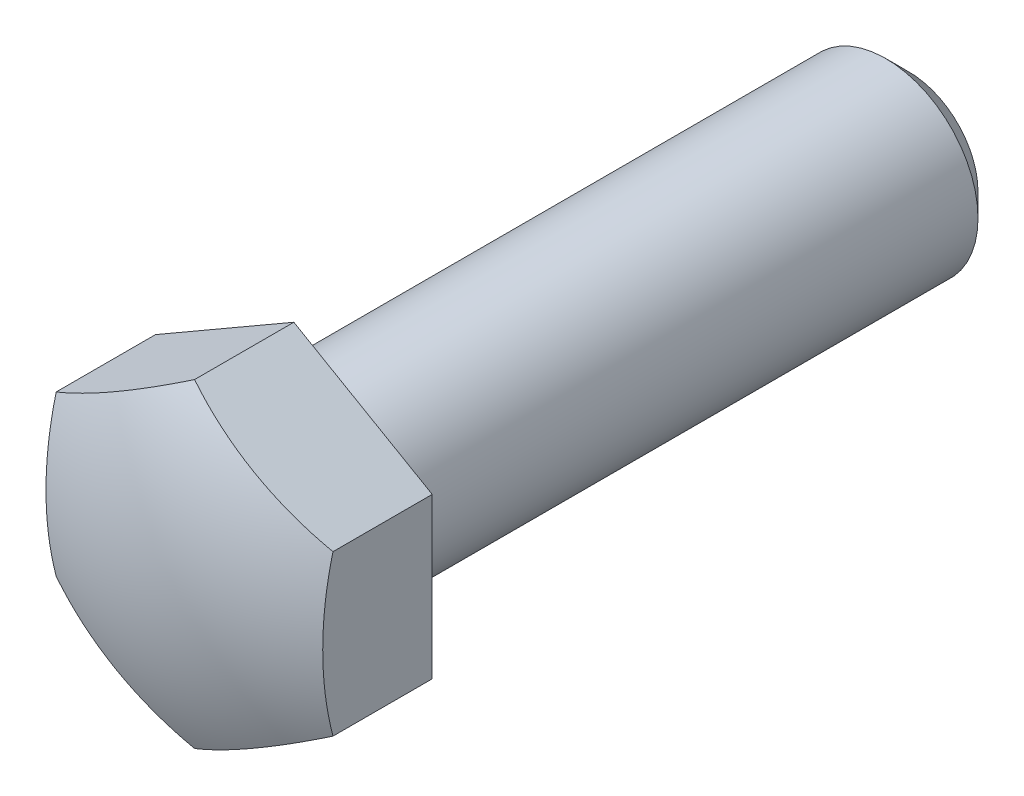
ISO-10303-21;
HEADER;
FILE_DESCRIPTION(('STEP AP214'),'2;1');
FILE_NAME('part.step','',(''),(''),'','','');
FILE_SCHEMA(('AUTOMOTIVE_DESIGN { 1 0 10303 214 1 1 1 1 }'));
ENDSEC;
DATA;
#1=APPLICATION_CONTEXT('core data for automotive mechanical design processes');
#2=APPLICATION_PROTOCOL_DEFINITION('international standard','automotive_design',2000,#1);
#3=PRODUCT_CONTEXT('',#1,'mechanical');
#4=PRODUCT('Part','Part','',(#3));
#5=PRODUCT_RELATED_PRODUCT_CATEGORY('part','',(#4));
#6=PRODUCT_DEFINITION_FORMATION('','',#4);
#7=PRODUCT_DEFINITION_CONTEXT('part definition',#1,'design');
#8=PRODUCT_DEFINITION('design','',#6,#7);
#9=PRODUCT_DEFINITION_SHAPE('','',#8);
#10=(LENGTH_UNIT() NAMED_UNIT(*) SI_UNIT(.MILLI.,.METRE.));
#11=(NAMED_UNIT(*) PLANE_ANGLE_UNIT() SI_UNIT($,.RADIAN.));
#12=(NAMED_UNIT(*) SI_UNIT($,.STERADIAN.) SOLID_ANGLE_UNIT());
#13=UNCERTAINTY_MEASURE_WITH_UNIT(LENGTH_MEASURE(1.E-05),#10,'distance_accuracy_value','');
#14=(GEOMETRIC_REPRESENTATION_CONTEXT(3) GLOBAL_UNCERTAINTY_ASSIGNED_CONTEXT((#13)) GLOBAL_UNIT_ASSIGNED_CONTEXT((#10,
#11,#12)) REPRESENTATION_CONTEXT('',''));
#15=CARTESIAN_POINT('',(0.,0.,0.));
#16=DIRECTION('',(0.,0.,1.));
#17=DIRECTION('',(1.,0.,0.));
#18=AXIS2_PLACEMENT_3D('',#15,#16,#17);
#19=CARTESIAN_POINT('',(12.,0.,0.));
#20=DIRECTION('',(0.,0.,1.));
#21=DIRECTION('',(1.,0.,0.));
#22=AXIS2_PLACEMENT_3D('',#19,#20,#21);
#23=PLANE('',#22);
#24=CARTESIAN_POINT('',(0.,0.,0.));
#25=DIRECTION('',(0.,0.,1.));
#26=DIRECTION('',(1.,0.,0.));
#27=AXIS2_PLACEMENT_3D('',#24,#25,#26);
#28=CIRCLE('',#27,12.);
#29=CARTESIAN_POINT('',(12.,0.,0.));
#30=VERTEX_POINT('',#29);
#31=EDGE_CURVE('E110',#30,#30,#28,.T.);
#32=ORIENTED_EDGE('',*,*,#31,.T.);
#33=EDGE_LOOP('',(#32));
#34=FACE_BOUND('',#33,.T.);
#35=DIRECTION('',(-0.86602540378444,-0.5,0.));
#36=VECTOR('',#35,1.);
#37=CARTESIAN_POINT('',(18.,-10.3923048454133,0.));
#38=LINE('',#37,#36);
#39=CARTESIAN_POINT('',(18.,-10.3923048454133,0.));
#40=VERTEX_POINT('',#39);
#41=CARTESIAN_POINT('',(0.,-20.7846096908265,0.));
#42=VERTEX_POINT('',#41);
#43=EDGE_CURVE('E107',#40,#42,#38,.T.);
#44=ORIENTED_EDGE('',*,*,#43,.T.);
#45=DIRECTION('',(0.86602540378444,-0.5,0.));
#46=VECTOR('',#45,1.);
#47=CARTESIAN_POINT('',(-18.,-10.3923048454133,0.));
#48=LINE('',#47,#46);
#49=CARTESIAN_POINT('',(-18.,-10.3923048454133,0.));
#50=VERTEX_POINT('',#49);
#51=EDGE_CURVE('E85',#50,#42,#48,.T.);
#52=ORIENTED_EDGE('',*,*,#51,.F.);
#53=DIRECTION('',(0.,-1.,0.));
#54=VECTOR('',#53,1.);
#55=CARTESIAN_POINT('',(-18.,10.3923048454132,0.));
#56=LINE('',#55,#54);
#57=CARTESIAN_POINT('',(-18.,10.3923048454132,0.));
#58=VERTEX_POINT('',#57);
#59=EDGE_CURVE('E62',#58,#50,#56,.T.);
#60=ORIENTED_EDGE('',*,*,#59,.F.);
#61=DIRECTION('',(0.866025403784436,0.5,0.));
#62=VECTOR('',#61,1.);
#63=CARTESIAN_POINT('',(-18.,10.3923048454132,0.));
#64=LINE('',#63,#62);
#65=CARTESIAN_POINT('',(0.,20.7846096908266,0.));
#66=VERTEX_POINT('',#65);
#67=EDGE_CURVE('E109',#58,#66,#64,.T.);
#68=ORIENTED_EDGE('',*,*,#67,.T.);
#69=DIRECTION('',(-0.866025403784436,0.5,0.));
#70=VECTOR('',#69,1.);
#71=CARTESIAN_POINT('',(18.,10.3923048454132,0.));
#72=LINE('',#71,#70);
#73=CARTESIAN_POINT('',(18.,10.3923048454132,0.));
#74=VERTEX_POINT('',#73);
#75=EDGE_CURVE('E100',#74,#66,#72,.T.);
#76=ORIENTED_EDGE('',*,*,#75,.F.);
#77=DIRECTION('',(0.,-1.,0.));
#78=VECTOR('',#77,1.);
#79=CARTESIAN_POINT('',(18.,10.3923048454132,0.));
#80=LINE('',#79,#78);
#81=EDGE_CURVE('E82',#74,#40,#80,.T.);
#82=ORIENTED_EDGE('',*,*,#81,.T.);
#83=EDGE_LOOP('',(#44,#52,#60,#68,#76,#82));
#84=FACE_BOUND('',#83,.T.);
#85=ADVANCED_FACE('F14',(#34,#84),#23,.F.);
#86=CARTESIAN_POINT('',(0.,0.,-20.));
#87=DIRECTION('',(0.,0.,1.));
#88=DIRECTION('',(1.,0.,0.));
#89=AXIS2_PLACEMENT_3D('',#86,#87,#88);
#90=CYLINDRICAL_SURFACE('',#89,12.);
#91=CARTESIAN_POINT('',(0.,0.,-77.));
#92=DIRECTION('',(0.,0.,1.));
#93=DIRECTION('',(1.,0.,0.));
#94=AXIS2_PLACEMENT_3D('',#91,#92,#93);
#95=CIRCLE('',#94,12.);
#96=CARTESIAN_POINT('',(12.,0.,-77.));
#97=VERTEX_POINT('',#96);
#98=EDGE_CURVE('E23',#97,#97,#95,.T.);
#99=ORIENTED_EDGE('',*,*,#98,.T.);
#100=EDGE_LOOP('',(#99));
#101=FACE_BOUND('',#100,.T.);
#102=ORIENTED_EDGE('',*,*,#31,.F.);
#103=EDGE_LOOP('',(#102));
#104=FACE_BOUND('',#103,.T.);
#105=ADVANCED_FACE('F146',(#101,#104),#90,.T.);
#106=CARTESIAN_POINT('',(0.,0.,-80.));
#107=DIRECTION('',(0.,0.,1.));
#108=DIRECTION('',(1.,0.,0.));
#109=AXIS2_PLACEMENT_3D('',#106,#107,#108);
#110=PLANE('',#109);
#111=CARTESIAN_POINT('',(0.,0.,-80.));
#112=DIRECTION('',(0.,0.,1.));
#113=DIRECTION('',(1.,0.,0.));
#114=AXIS2_PLACEMENT_3D('',#111,#112,#113);
#115=CIRCLE('',#114,9.);
#116=CARTESIAN_POINT('',(9.,0.,-80.));
#117=VERTEX_POINT('',#116);
#118=EDGE_CURVE('E9',#117,#117,#115,.F.);
#119=ORIENTED_EDGE('',*,*,#118,.T.);
#120=EDGE_LOOP('',(#119));
#121=FACE_BOUND('',#120,.T.);
#122=ADVANCED_FACE('F152',(#121),#110,.F.);
#123=CARTESIAN_POINT('',(-18.,-10.3923048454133,18.));
#124=DIRECTION('',(0.5,0.86602540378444,0.));
#125=DIRECTION('',(-0.86602540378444,0.5,0.));
#126=AXIS2_PLACEMENT_3D('',#123,#124,#125);
#127=PLANE('',#126);
#128=CARTESIAN_POINT('',(-9.,-15.5884572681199,-27.));
#129=DIRECTION('',(0.5,0.86602540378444,0.));
#130=DIRECTION('',(-0.86602540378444,0.5,0.));
#131=AXIS2_PLACEMENT_3D('',#128,#129,#130);
#132=CIRCLE('',#131,41.2431812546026);
#133=CARTESIAN_POINT('',(0.,-20.7846096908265,12.9124040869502));
#134=VERTEX_POINT('',#133);
#135=CARTESIAN_POINT('',(-18.,-10.3923048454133,12.9124040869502));
#136=VERTEX_POINT('',#135);
#137=EDGE_CURVE('E76',#134,#136,#132,.F.);
#138=ORIENTED_EDGE('',*,*,#137,.T.);
#139=DIRECTION('',(0.,0.,-1.));
#140=VECTOR('',#139,1.);
#141=CARTESIAN_POINT('',(-18.,-10.3923048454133,18.));
#142=LINE('',#141,#140);
#143=EDGE_CURVE('E78',#136,#50,#142,.T.);
#144=ORIENTED_EDGE('',*,*,#143,.T.);
#145=ORIENTED_EDGE('',*,*,#51,.T.);
#146=DIRECTION('',(0.,0.,-1.));
#147=VECTOR('',#146,1.);
#148=CARTESIAN_POINT('',(0.,-20.7846096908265,18.));
#149=LINE('',#148,#147);
#150=EDGE_CURVE('E31',#134,#42,#149,.T.);
#151=ORIENTED_EDGE('',*,*,#150,.F.);
#152=EDGE_LOOP('',(#138,#144,#145,#151));
#153=FACE_BOUND('',#152,.T.);
#154=ADVANCED_FACE('F77',(#153),#127,.F.);
#155=CARTESIAN_POINT('',(-18.,10.3923048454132,18.));
#156=DIRECTION('',(1.,0.,0.));
#157=DIRECTION('',(0.,1.,0.));
#158=AXIS2_PLACEMENT_3D('',#155,#156,#157);
#159=PLANE('',#158);
#160=CARTESIAN_POINT('',(-18.,0.,-27.));
#161=DIRECTION('',(1.,0.,0.));
#162=DIRECTION('',(0.,1.,0.));
#163=AXIS2_PLACEMENT_3D('',#160,#161,#162);
#164=CIRCLE('',#163,41.2431812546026);
#165=CARTESIAN_POINT('',(-18.,10.3923048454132,12.9124040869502));
#166=VERTEX_POINT('',#165);
#167=EDGE_CURVE('E71',#136,#166,#164,.F.);
#168=ORIENTED_EDGE('',*,*,#167,.T.);
#169=DIRECTION('',(0.,0.,-1.));
#170=VECTOR('',#169,1.);
#171=CARTESIAN_POINT('',(-18.,10.3923048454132,18.));
#172=LINE('',#171,#170);
#173=EDGE_CURVE('E91',#166,#58,#172,.T.);
#174=ORIENTED_EDGE('',*,*,#173,.T.);
#175=ORIENTED_EDGE('',*,*,#59,.T.);
#176=ORIENTED_EDGE('',*,*,#143,.F.);
#177=EDGE_LOOP('',(#168,#174,#175,#176));
#178=FACE_BOUND('',#177,.T.);
#179=ADVANCED_FACE('F84',(#178),#159,.F.);
#180=CARTESIAN_POINT('',(-18.,10.3923048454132,18.));
#181=DIRECTION('',(-0.5,0.866025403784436,0.));
#182=DIRECTION('',(-0.866025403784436,-0.5,0.));
#183=AXIS2_PLACEMENT_3D('',#180,#181,#182);
#184=PLANE('',#183);
#185=DIRECTION('',(0.,0.,-1.));
#186=VECTOR('',#185,1.);
#187=CARTESIAN_POINT('',(0.,20.7846096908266,18.));
#188=LINE('',#187,#186);
#189=CARTESIAN_POINT('',(0.,20.7846096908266,12.9124040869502));
#190=VERTEX_POINT('',#189);
#191=EDGE_CURVE('E53',#190,#66,#188,.T.);
#192=ORIENTED_EDGE('',*,*,#191,.T.);
#193=ORIENTED_EDGE('',*,*,#67,.F.);
#194=ORIENTED_EDGE('',*,*,#173,.F.);
#195=CARTESIAN_POINT('',(-9.,15.5884572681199,-27.));
#196=DIRECTION('',(-0.5,0.866025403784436,0.));
#197=DIRECTION('',(-0.866025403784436,-0.5,0.));
#198=AXIS2_PLACEMENT_3D('',#195,#196,#197);
#199=CIRCLE('',#198,41.2431812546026);
#200=EDGE_CURVE('E90',#190,#166,#199,.F.);
#201=ORIENTED_EDGE('',*,*,#200,.F.);
#202=EDGE_LOOP('',(#192,#193,#194,#201));
#203=FACE_BOUND('',#202,.T.);
#204=ADVANCED_FACE('F134',(#203),#184,.T.);
#205=CARTESIAN_POINT('',(18.,10.3923048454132,18.));
#206=DIRECTION('',(-0.5,-0.866025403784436,0.));
#207=DIRECTION('',(0.866025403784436,-0.5,0.));
#208=AXIS2_PLACEMENT_3D('',#205,#206,#207);
#209=PLANE('',#208);
#210=CARTESIAN_POINT('',(9.,15.5884572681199,-27.));
#211=DIRECTION('',(-0.5,-0.866025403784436,0.));
#212=DIRECTION('',(0.866025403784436,-0.5,0.));
#213=AXIS2_PLACEMENT_3D('',#210,#211,#212);
#214=CIRCLE('',#213,41.2431812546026);
#215=CARTESIAN_POINT('',(18.,10.3923048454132,12.9124040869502));
#216=VERTEX_POINT('',#215);
#217=EDGE_CURVE('E103',#190,#216,#214,.F.);
#218=ORIENTED_EDGE('',*,*,#217,.T.);
#219=DIRECTION('',(0.,0.,-1.));
#220=VECTOR('',#219,1.);
#221=CARTESIAN_POINT('',(18.,10.3923048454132,18.));
#222=LINE('',#221,#220);
#223=EDGE_CURVE('E101',#216,#74,#222,.T.);
#224=ORIENTED_EDGE('',*,*,#223,.T.);
#225=ORIENTED_EDGE('',*,*,#75,.T.);
#226=ORIENTED_EDGE('',*,*,#191,.F.);
#227=EDGE_LOOP('',(#218,#224,#225,#226));
#228=FACE_BOUND('',#227,.T.);
#229=ADVANCED_FACE('F127',(#228),#209,.F.);
#230=CARTESIAN_POINT('',(18.,10.3923048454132,18.));
#231=DIRECTION('',(1.,0.,0.));
#232=DIRECTION('',(0.,1.,0.));
#233=AXIS2_PLACEMENT_3D('',#230,#231,#232);
#234=PLANE('',#233);
#235=DIRECTION('',(0.,0.,-1.));
#236=VECTOR('',#235,1.);
#237=CARTESIAN_POINT('',(18.,-10.3923048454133,18.));
#238=LINE('',#237,#236);
#239=CARTESIAN_POINT('',(18.,-10.3923048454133,12.9124040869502));
#240=VERTEX_POINT('',#239);
#241=EDGE_CURVE('E98',#240,#40,#238,.T.);
#242=ORIENTED_EDGE('',*,*,#241,.T.);
#243=ORIENTED_EDGE('',*,*,#81,.F.);
#244=ORIENTED_EDGE('',*,*,#223,.F.);
#245=CARTESIAN_POINT('',(18.,0.,-27.));
#246=DIRECTION('',(1.,0.,0.));
#247=DIRECTION('',(0.,1.,0.));
#248=AXIS2_PLACEMENT_3D('',#245,#246,#247);
#249=CIRCLE('',#248,41.2431812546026);
#250=EDGE_CURVE('E120',#240,#216,#249,.F.);
#251=ORIENTED_EDGE('',*,*,#250,.F.);
#252=EDGE_LOOP('',(#242,#243,#244,#251));
#253=FACE_BOUND('',#252,.T.);
#254=ADVANCED_FACE('F130',(#253),#234,.T.);
#255=CARTESIAN_POINT('',(18.,-10.3923048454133,18.));
#256=DIRECTION('',(0.5,-0.86602540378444,0.));
#257=DIRECTION('',(0.86602540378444,0.5,0.));
#258=AXIS2_PLACEMENT_3D('',#255,#256,#257);
#259=PLANE('',#258);
#260=ORIENTED_EDGE('',*,*,#150,.T.);
#261=ORIENTED_EDGE('',*,*,#43,.F.);
#262=ORIENTED_EDGE('',*,*,#241,.F.);
#263=CARTESIAN_POINT('',(9.,-15.5884572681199,-27.));
#264=DIRECTION('',(0.5,-0.86602540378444,0.));
#265=DIRECTION('',(0.86602540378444,0.5,0.));
#266=AXIS2_PLACEMENT_3D('',#263,#264,#265);
#267=CIRCLE('',#266,41.2431812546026);
#268=EDGE_CURVE('E106',#134,#240,#267,.F.);
#269=ORIENTED_EDGE('',*,*,#268,.F.);
#270=EDGE_LOOP('',(#260,#261,#262,#269));
#271=FACE_BOUND('',#270,.T.);
#272=ADVANCED_FACE('F158',(#271),#259,.T.);
#273=CARTESIAN_POINT('',(0.,0.,-27.));
#274=DIRECTION('',(0.,0.,1.));
#275=DIRECTION('',(1.,0.,0.));
#276=AXIS2_PLACEMENT_3D('',#273,#274,#275);
#277=SPHERICAL_SURFACE('',#276,45.);
#278=ORIENTED_EDGE('',*,*,#137,.F.);
#279=ORIENTED_EDGE('',*,*,#268,.T.);
#280=ORIENTED_EDGE('',*,*,#250,.T.);
#281=ORIENTED_EDGE('',*,*,#217,.F.);
#282=ORIENTED_EDGE('',*,*,#200,.T.);
#283=ORIENTED_EDGE('',*,*,#167,.F.);
#284=EDGE_LOOP('',(#278,#279,#280,#281,#282,#283));
#285=FACE_BOUND('',#284,.T.);
#286=ADVANCED_FACE('F88',(#285),#277,.T.);
#287=CARTESIAN_POINT('',(0.,0.,-77.));
#288=DIRECTION('',(0.,0.,1.));
#289=DIRECTION('',(1.,0.,0.));
#290=AXIS2_PLACEMENT_3D('',#287,#288,#289);
#291=CONICAL_SURFACE('',#290,12.,0.78539816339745);
#292=ORIENTED_EDGE('',*,*,#118,.F.);
#293=EDGE_LOOP('',(#292));
#294=FACE_BOUND('',#293,.T.);
#295=ORIENTED_EDGE('',*,*,#98,.F.);
#296=EDGE_LOOP('',(#295));
#297=FACE_BOUND('',#296,.T.);
#298=ADVANCED_FACE('F16',(#294,#297),#291,.T.);
#299=CLOSED_SHELL('',(#85,#105,#122,#154,#179,#204,#229,#254,#272,#286,#298));
#300=MANIFOLD_SOLID_BREP('B1',#299);
#301=ADVANCED_BREP_SHAPE_REPRESENTATION('',(#18,#300),#14);
#302=SHAPE_DEFINITION_REPRESENTATION(#9,#301);
ENDSEC;
END-ISO-10303-21;
